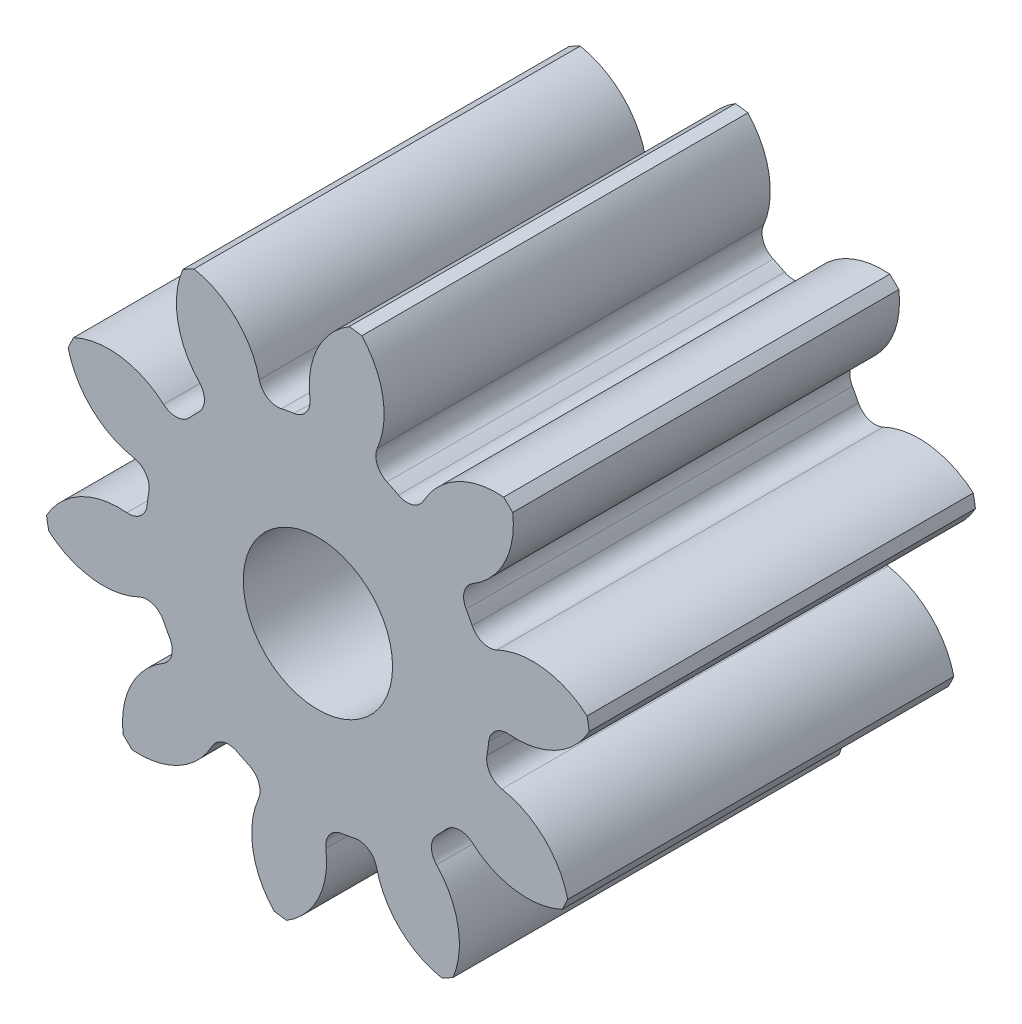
from build123d import *

# Parameters (mm, degrees)
SKETCH3_R         = 67.733333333
GEARBODY_DEPTH    = 95.25
TOOTHCUT_DEPTH    = 136.085792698
CIRPATTERN1_COUNT = 10
BOREDIA_R         = 18.415
BORE_DEPTH        = 12700


with BuildPart() as part:
    # Sketch3 → gearBody (new body)
    with BuildSketch(Plane.XY):
        Circle(SKETCH3_R)
    extrude(amount=GEARBODY_DEPTH)

    # Sketch2 → toothCut (cut, through all)
    with BuildSketch(Plane.XY):
        with BuildLine():
            ThreePointArc((41.688842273, -7.358773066), (41.934761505, -5.795419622), (42.122075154, -4.223966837))
            ThreePointArc((42.122075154, -4.223966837), (43.771461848, -1.136914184), (47.116658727, -0.107337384))
            ThreePointArc((47.116658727, -0.107337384), (59.370619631, 2.621857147), (67.733333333, 11.985247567))
            ThreePointArc((67.733333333, 11.985247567), (68.137919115, -9.416718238), (61.943824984, -29.90674088))
            ThreePointArc((61.943824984, -29.90674088), (56.434124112, -18.626170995), (45.379695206, -12.675737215))
            ThreePointArc((45.379695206, -12.675737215), (42.439129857, -10.777462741), (41.688842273, -7.358773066))
        make_face()
    toothcut = extrude(amount=TOOTHCUT_DEPTH, mode=Mode.SUBTRACT)

    # CirPattern1: toothCut ×10 about axis
    cirpattern1_axis = Axis((0, 0, 0), (0, 0, 1))
    for i in range(1, CIRPATTERN1_COUNT):
        add(toothcut.rotate(cirpattern1_axis, i * 360 / CIRPATTERN1_COUNT), mode=Mode.SUBTRACT)

    # boreDia → bore (cut, symmetric)
    with BuildSketch(Plane.XY):
        Circle(BOREDIA_R)
    extrude(amount=BORE_DEPTH, both=True, mode=Mode.SUBTRACT)


solid = part.part
